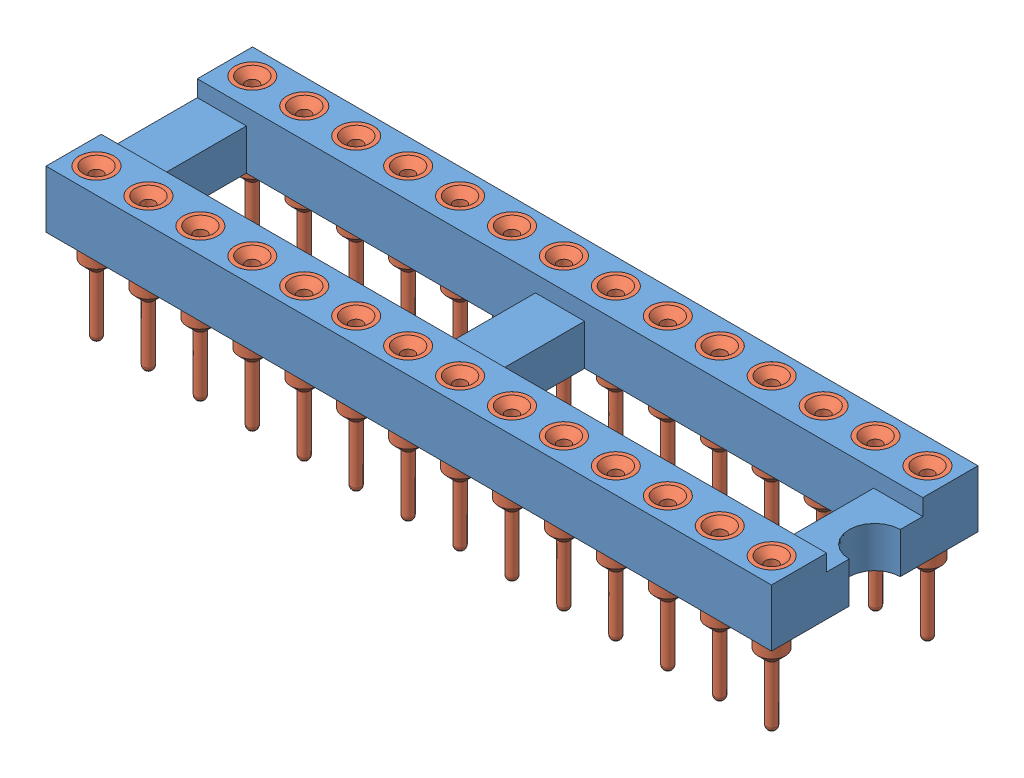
SolidWorks assembly dip28.SLDASM, configuration Default (file format 8000). Lengths in mm.
Overall size (35.48 7.37 10.1).
29 component instances, 2 part files, 2 mates.
Components (placement in the parent):
- dip28-1: dip28.SLDPRT [Default] at origin size (35.48 2.8 10.1)
- dip socket pin-1: dip socket pin.SLDPRT [Default] at (16.51 2.8 -3.81) size (1.7 7.37 1.7)
- dip socket pin-2: dip socket pin.SLDPRT [Default] at (16.51 2.8 3.81) size (1.7 7.37 1.7)
- dip socket pin-3: dip socket pin.SLDPRT [Default] at (13.97 2.8 -3.81) size (1.7 7.37 1.7)
- dip socket pin-4: dip socket pin.SLDPRT [Default] at (13.97 2.8 3.81) size (1.7 7.37 1.7)
- dip socket pin-5: dip socket pin.SLDPRT [Default] at (11.43 2.8 -3.81) size (1.7 7.37 1.7)
- dip socket pin-6: dip socket pin.SLDPRT [Default] at (11.43 2.8 3.81) size (1.7 7.37 1.7)
- dip socket pin-7: dip socket pin.SLDPRT [Default] at (8.89 2.8 -3.81) size (1.7 7.37 1.7)
- dip socket pin-8: dip socket pin.SLDPRT [Default] at (8.89 2.8 3.81) size (1.7 7.37 1.7)
- dip socket pin-9: dip socket pin.SLDPRT [Default] at (6.35 2.8 -3.81) size (1.7 7.37 1.7)
- dip socket pin-10: dip socket pin.SLDPRT [Default] at (6.35 2.8 3.81) size (1.7 7.37 1.7)
- dip socket pin-11: dip socket pin.SLDPRT [Default] at (3.81 2.8 -3.81) size (1.7 7.37 1.7)
- dip socket pin-12: dip socket pin.SLDPRT [Default] at (3.81 2.8 3.81) size (1.7 7.37 1.7)
- dip socket pin-13: dip socket pin.SLDPRT [Default] at (1.27 2.8 -3.81) size (1.7 7.37 1.7)
- dip socket pin-14: dip socket pin.SLDPRT [Default] at (1.27 2.8 3.81) size (1.7 7.37 1.7)
- dip socket pin-15: dip socket pin.SLDPRT [Default] at (-1.27 2.8 -3.81) size (1.7 7.37 1.7)
- dip socket pin-16: dip socket pin.SLDPRT [Default] at (-1.27 2.8 3.81) size (1.7 7.37 1.7)
- dip socket pin-17: dip socket pin.SLDPRT [Default] at (-3.81 2.8 -3.81) size (1.7 7.37 1.7)
- dip socket pin-18: dip socket pin.SLDPRT [Default] at (-3.81 2.8 3.81) size (1.7 7.37 1.7)
- dip socket pin-19: dip socket pin.SLDPRT [Default] at (-6.35 2.8 -3.81) size (1.7 7.37 1.7)
- dip socket pin-20: dip socket pin.SLDPRT [Default] at (-6.35 2.8 3.81) size (1.7 7.37 1.7)
- dip socket pin-21: dip socket pin.SLDPRT [Default] at (-8.89 2.8 -3.81) size (1.7 7.37 1.7)
- dip socket pin-22: dip socket pin.SLDPRT [Default] at (-8.89 2.8 3.81) size (1.7 7.37 1.7)
- dip socket pin-23: dip socket pin.SLDPRT [Default] at (-11.43 2.8 -3.81) size (1.7 7.37 1.7)
- dip socket pin-24: dip socket pin.SLDPRT [Default] at (-11.43 2.8 3.81) size (1.7 7.37 1.7)
- dip socket pin-25: dip socket pin.SLDPRT [Default] at (-13.97 2.8 -3.81) size (1.7 7.37 1.7)
- dip socket pin-26: dip socket pin.SLDPRT [Default] at (-13.97 2.8 3.81) size (1.7 7.37 1.7)
- dip socket pin-27: dip socket pin.SLDPRT [Default] at (-16.51 2.8 -3.81) size (1.7 7.37 1.7)
- dip socket pin-28: dip socket pin.SLDPRT [Default] at (-16.51 2.8 3.81) size (1.7 7.37 1.7)
Mates (geometry in assembly coordinates):
- Concentric1: concentric aligned: cylinder of dip28-1 through (16.51 2.8 -3.81) axis (0 1 0) radius 0.85; cylinder of dip socket pin-1 through (16.51 31.7926 -3.81) axis (0 1 0) radius 0.675
- Coincident1: coincident aligned: plane of dip28-1 through (17.74 2.8 -2.35) normal (0 1 0); plane of dip socket pin-1 through (15.66 2.8 -3.81) normal (0 1 0)
